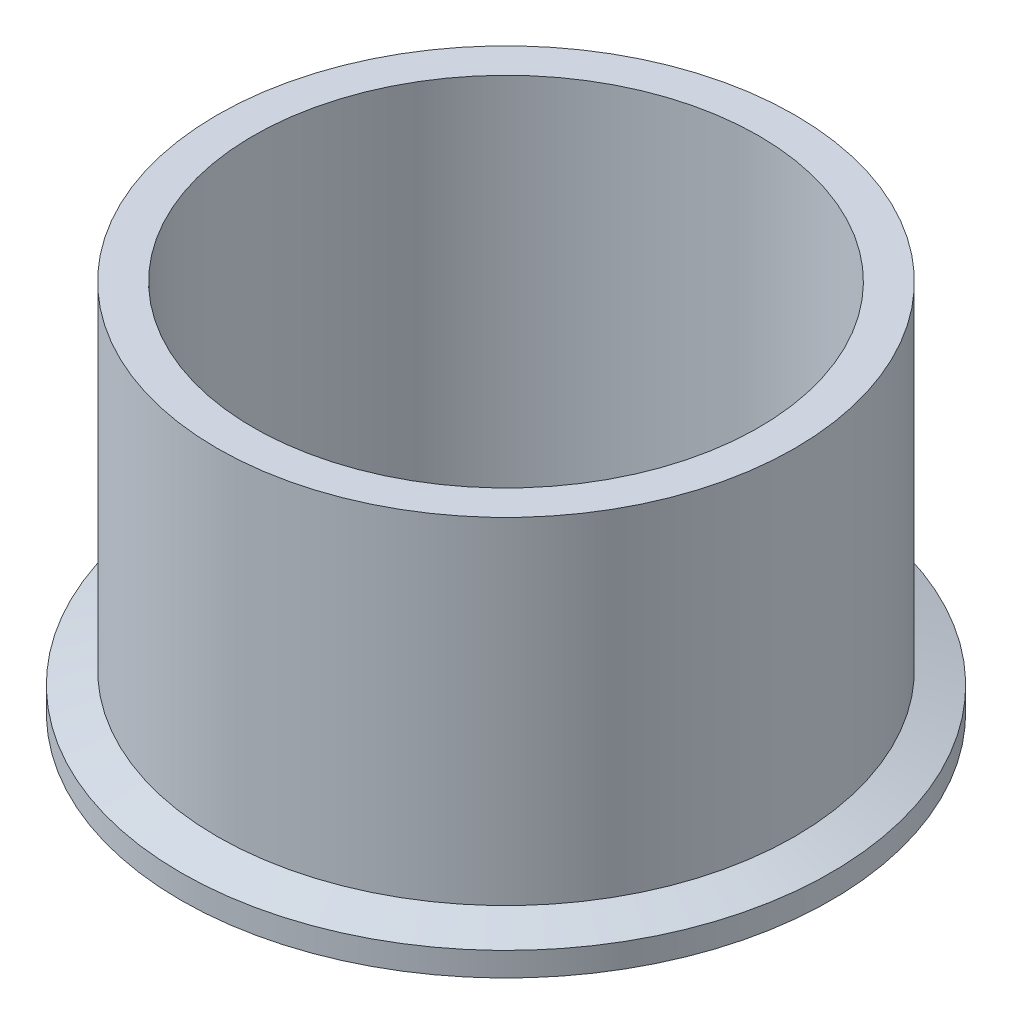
from build123d import *


with BuildPart() as part:
    # Sketch1 → Revolve2 (revolve)
    with BuildSketch(Plane.XY, mode=Mode.PRIVATE) as revolve2_sk:
        with BuildLine():
            Line((-30.099, 0), (-30.099, 44.45))
            Line((-30.099, 44.45), (-34.3916, 44.45))
            Line((-34.3916, 44.45), (-34.3916, 4.416423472))
            Line((-34.3916, 4.416423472), (-38.7096, 2.8448))
            Line((-38.7096, 2.8448), (-38.7096, 0))
            Line((-38.7096, 0), (-36.788103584, 0))
            Line((-36.788103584, 0), (-36.417598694, 0.872854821))
            ThreePointArc((-36.417598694, 0.872854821), (-35.259772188, 1.598744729), (-34.179162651, 0.762227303))
            Line((-34.179162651, 0.762227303), (-33.855616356, 0))
            Line((-33.855616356, 0), (-30.099, 0))
        make_face()
    revolve(revolve2_sk.sketch.rotate(Axis((0, 0, 0), (0, 1, 0)), 270), axis=Axis((0, 0, 0), (0, 1, 0)))


solid = part.part
